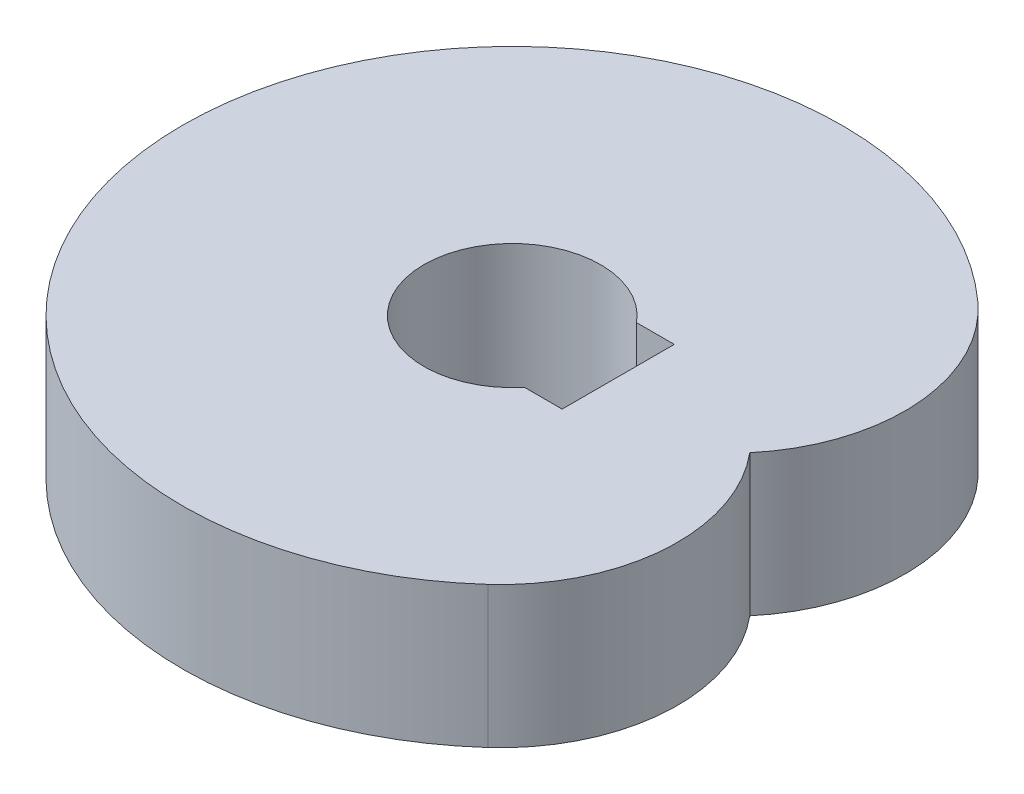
ISO-10303-21;
HEADER;
FILE_DESCRIPTION(('STEP AP214'),'2;1');
FILE_NAME('part.step','',(''),(''),'','','');
FILE_SCHEMA(('AUTOMOTIVE_DESIGN { 1 0 10303 214 1 1 1 1 }'));
ENDSEC;
DATA;
#1=APPLICATION_CONTEXT('core data for automotive mechanical design processes');
#2=APPLICATION_PROTOCOL_DEFINITION('international standard','automotive_design',2000,#1);
#3=PRODUCT_CONTEXT('',#1,'mechanical');
#4=PRODUCT('Part','Part','',(#3));
#5=PRODUCT_RELATED_PRODUCT_CATEGORY('part','',(#4));
#6=PRODUCT_DEFINITION_FORMATION('','',#4);
#7=PRODUCT_DEFINITION_CONTEXT('part definition',#1,'design');
#8=PRODUCT_DEFINITION('design','',#6,#7);
#9=PRODUCT_DEFINITION_SHAPE('','',#8);
#10=(LENGTH_UNIT() NAMED_UNIT(*) SI_UNIT(.MILLI.,.METRE.));
#11=(NAMED_UNIT(*) PLANE_ANGLE_UNIT() SI_UNIT($,.RADIAN.));
#12=(NAMED_UNIT(*) SI_UNIT($,.STERADIAN.) SOLID_ANGLE_UNIT());
#13=UNCERTAINTY_MEASURE_WITH_UNIT(LENGTH_MEASURE(1.E-05),#10,'distance_accuracy_value','');
#14=(GEOMETRIC_REPRESENTATION_CONTEXT(3) GLOBAL_UNCERTAINTY_ASSIGNED_CONTEXT((#13)) GLOBAL_UNIT_ASSIGNED_CONTEXT((#10,
#11,#12)) REPRESENTATION_CONTEXT('',''));
#15=CARTESIAN_POINT('',(0.,0.,0.));
#16=DIRECTION('',(0.,0.,1.));
#17=DIRECTION('',(1.,0.,0.));
#18=AXIS2_PLACEMENT_3D('',#15,#16,#17);
#19=CARTESIAN_POINT('',(-12.9999999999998,0.,119.));
#20=DIRECTION('',(0.,0.,1.));
#21=DIRECTION('',(1.,0.,0.));
#22=AXIS2_PLACEMENT_3D('',#19,#20,#21);
#23=PLANE('',#22);
#24=DIRECTION('',(0.,1.,0.));
#25=VECTOR('',#24,1.);
#26=CARTESIAN_POINT('',(144.897377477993,300.,119.));
#27=LINE('',#26,#25);
#28=CARTESIAN_POINT('',(144.897377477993,0.,119.));
#29=VERTEX_POINT('',#28);
#30=CARTESIAN_POINT('',(144.897377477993,300.,119.));
#31=VERTEX_POINT('',#30);
#32=EDGE_CURVE('E124',#29,#31,#27,.T.);
#33=ORIENTED_EDGE('',*,*,#32,.T.);
#34=DIRECTION('',(1.,0.,0.));
#35=VECTOR('',#34,1.);
#36=CARTESIAN_POINT('',(-12.9999999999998,300.,119.));
#37=LINE('',#36,#35);
#38=CARTESIAN_POINT('',(225.,300.,119.));
#39=VERTEX_POINT('',#38);
#40=EDGE_CURVE('E114',#31,#39,#37,.T.);
#41=ORIENTED_EDGE('',*,*,#40,.T.);
#42=DIRECTION('',(0.,1.,0.));
#43=VECTOR('',#42,1.);
#44=CARTESIAN_POINT('',(225.,0.,119.));
#45=LINE('',#44,#43);
#46=CARTESIAN_POINT('',(225.,0.,119.));
#47=VERTEX_POINT('',#46);
#48=EDGE_CURVE('E11',#47,#39,#45,.T.);
#49=ORIENTED_EDGE('',*,*,#48,.F.);
#50=DIRECTION('',(1.,0.,0.));
#51=VECTOR('',#50,1.);
#52=CARTESIAN_POINT('',(0.,0.,119.));
#53=LINE('',#52,#51);
#54=EDGE_CURVE('E121',#29,#47,#53,.T.);
#55=ORIENTED_EDGE('',*,*,#54,.F.);
#56=EDGE_LOOP('',(#33,#41,#49,#55));
#57=FACE_BOUND('',#56,.T.);
#58=ADVANCED_FACE('F16',(#57),#23,.F.);
#59=CARTESIAN_POINT('',(225.,0.,-119.));
#60=DIRECTION('',(1.,0.,0.));
#61=DIRECTION('',(0.,1.,0.));
#62=AXIS2_PLACEMENT_3D('',#59,#60,#61);
#63=PLANE('',#62);
#64=DIRECTION('',(0.,0.,-1.));
#65=VECTOR('',#64,1.);
#66=CARTESIAN_POINT('',(225.,300.,-119.));
#67=LINE('',#66,#65);
#68=CARTESIAN_POINT('',(225.,300.,-119.));
#69=VERTEX_POINT('',#68);
#70=EDGE_CURVE('E158',#39,#69,#67,.T.);
#71=ORIENTED_EDGE('',*,*,#70,.T.);
#72=DIRECTION('',(0.,1.,0.));
#73=VECTOR('',#72,1.);
#74=CARTESIAN_POINT('',(225.,0.,-119.));
#75=LINE('',#74,#73);
#76=CARTESIAN_POINT('',(225.,0.,-119.));
#77=VERTEX_POINT('',#76);
#78=EDGE_CURVE('E26',#77,#69,#75,.T.);
#79=ORIENTED_EDGE('',*,*,#78,.F.);
#80=DIRECTION('',(0.,0.,-1.));
#81=VECTOR('',#80,1.);
#82=CARTESIAN_POINT('',(225.,0.,-119.));
#83=LINE('',#82,#81);
#84=EDGE_CURVE('E157',#47,#77,#83,.T.);
#85=ORIENTED_EDGE('',*,*,#84,.F.);
#86=ORIENTED_EDGE('',*,*,#48,.T.);
#87=EDGE_LOOP('',(#71,#79,#85,#86));
#88=FACE_BOUND('',#87,.T.);
#89=ADVANCED_FACE('F205',(#88),#63,.F.);
#90=CARTESIAN_POINT('',(-12.9999999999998,0.,-119.));
#91=DIRECTION('',(0.,0.,-1.));
#92=DIRECTION('',(0.,-1.,0.));
#93=AXIS2_PLACEMENT_3D('',#90,#91,#92);
#94=PLANE('',#93);
#95=DIRECTION('',(0.,-1.,0.));
#96=VECTOR('',#95,1.);
#97=CARTESIAN_POINT('',(144.897377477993,300.,-119.));
#98=LINE('',#97,#96);
#99=CARTESIAN_POINT('',(144.897377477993,300.,-119.));
#100=VERTEX_POINT('',#99);
#101=CARTESIAN_POINT('',(144.897377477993,0.,-119.));
#102=VERTEX_POINT('',#101);
#103=EDGE_CURVE('E148',#100,#102,#98,.T.);
#104=ORIENTED_EDGE('',*,*,#103,.T.);
#105=DIRECTION('',(-1.,0.,0.));
#106=VECTOR('',#105,1.);
#107=CARTESIAN_POINT('',(-12.9999999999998,0.,-119.));
#108=LINE('',#107,#106);
#109=EDGE_CURVE('E129',#77,#102,#108,.T.);
#110=ORIENTED_EDGE('',*,*,#109,.F.);
#111=ORIENTED_EDGE('',*,*,#78,.T.);
#112=DIRECTION('',(-1.,0.,0.));
#113=VECTOR('',#112,1.);
#114=CARTESIAN_POINT('',(-12.9999999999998,300.,-119.));
#115=LINE('',#114,#113);
#116=EDGE_CURVE('E57',#69,#100,#115,.T.);
#117=ORIENTED_EDGE('',*,*,#116,.T.);
#118=EDGE_LOOP('',(#104,#110,#111,#117));
#119=FACE_BOUND('',#118,.T.);
#120=ADVANCED_FACE('F18',(#119),#94,.F.);
#121=CARTESIAN_POINT('',(0.,0.,0.));
#122=DIRECTION('',(0.,1.,0.));
#123=DIRECTION('',(1.,0.,0.));
#124=AXIS2_PLACEMENT_3D('',#121,#122,#123);
#125=PLANE('',#124);
#126=ORIENTED_EDGE('',*,*,#84,.T.);
#127=ORIENTED_EDGE('',*,*,#109,.T.);
#128=CARTESIAN_POINT('',(0.,0.,0.));
#129=DIRECTION('',(0.,1.,0.));
#130=DIRECTION('',(0.,0.,1.));
#131=AXIS2_PLACEMENT_3D('',#128,#129,#130);
#132=CIRCLE('',#131,187.5);
#133=EDGE_CURVE('E132',#102,#29,#132,.T.);
#134=ORIENTED_EDGE('',*,*,#133,.T.);
#135=ORIENTED_EDGE('',*,*,#54,.T.);
#136=EDGE_LOOP('',(#126,#127,#134,#135));
#137=FACE_BOUND('',#136,.T.);
#138=CARTESIAN_POINT('',(217.46744706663,0.,241.522068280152));
#139=DIRECTION('',(0.,1.,0.));
#140=DIRECTION('',(0.,0.,1.));
#141=AXIS2_PLACEMENT_3D('',#138,#139,#140);
#142=CIRCLE('',#141,375.);
#143=CARTESIAN_POINT('',(468.391424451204,0.,520.201377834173));
#144=VERTEX_POINT('',#143);
#145=CARTESIAN_POINT('',(504.333427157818,0.,-1.38777878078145E-13));
#146=VERTEX_POINT('',#145);
#147=EDGE_CURVE('E165',#144,#146,#142,.T.);
#148=ORIENTED_EDGE('',*,*,#147,.F.);
#149=CARTESIAN_POINT('',(0.,0.,0.));
#150=DIRECTION('',(0.,1.,0.));
#151=DIRECTION('',(0.,0.,1.));
#152=AXIS2_PLACEMENT_3D('',#149,#150,#151);
#153=CIRCLE('',#152,700.);
#154=CARTESIAN_POINT('',(468.391424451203,0.,-520.201377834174));
#155=VERTEX_POINT('',#154);
#156=EDGE_CURVE('E152',#155,#144,#153,.T.);
#157=ORIENTED_EDGE('',*,*,#156,.F.);
#158=CARTESIAN_POINT('',(217.46744706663,0.,-241.522068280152));
#159=DIRECTION('',(0.,1.,0.));
#160=DIRECTION('',(0.,0.,1.));
#161=AXIS2_PLACEMENT_3D('',#158,#159,#160);
#162=CIRCLE('',#161,375.);
#163=EDGE_CURVE('E164',#146,#155,#162,.T.);
#164=ORIENTED_EDGE('',*,*,#163,.F.);
#165=EDGE_LOOP('',(#148,#157,#164));
#166=FACE_BOUND('',#165,.T.);
#167=ADVANCED_FACE('F133',(#137,#166),#125,.F.);
#168=CARTESIAN_POINT('',(0.,300.,0.));
#169=DIRECTION('',(0.,1.,0.));
#170=DIRECTION('',(1.,0.,0.));
#171=AXIS2_PLACEMENT_3D('',#168,#169,#170);
#172=PLANE('',#171);
#173=ORIENTED_EDGE('',*,*,#116,.F.);
#174=ORIENTED_EDGE('',*,*,#70,.F.);
#175=ORIENTED_EDGE('',*,*,#40,.F.);
#176=CARTESIAN_POINT('',(0.,300.,0.));
#177=DIRECTION('',(0.,1.,0.));
#178=DIRECTION('',(0.,0.,1.));
#179=AXIS2_PLACEMENT_3D('',#176,#177,#178);
#180=CIRCLE('',#179,187.5);
#181=EDGE_CURVE('E140',#100,#31,#180,.T.);
#182=ORIENTED_EDGE('',*,*,#181,.F.);
#183=EDGE_LOOP('',(#173,#174,#175,#182));
#184=FACE_BOUND('',#183,.T.);
#185=CARTESIAN_POINT('',(217.46744706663,300.,241.522068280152));
#186=DIRECTION('',(0.,1.,0.));
#187=DIRECTION('',(0.,0.,1.));
#188=AXIS2_PLACEMENT_3D('',#185,#186,#187);
#189=CIRCLE('',#188,375.);
#190=CARTESIAN_POINT('',(468.391424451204,300.,520.201377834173));
#191=VERTEX_POINT('',#190);
#192=CARTESIAN_POINT('',(504.333427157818,300.,-1.38777878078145E-13));
#193=VERTEX_POINT('',#192);
#194=EDGE_CURVE('E170',#191,#193,#189,.T.);
#195=ORIENTED_EDGE('',*,*,#194,.T.);
#196=CARTESIAN_POINT('',(217.46744706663,300.,-241.522068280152));
#197=DIRECTION('',(0.,1.,0.));
#198=DIRECTION('',(0.,0.,1.));
#199=AXIS2_PLACEMENT_3D('',#196,#197,#198);
#200=CIRCLE('',#199,375.);
#201=CARTESIAN_POINT('',(468.391424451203,300.,-520.201377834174));
#202=VERTEX_POINT('',#201);
#203=EDGE_CURVE('E104',#193,#202,#200,.T.);
#204=ORIENTED_EDGE('',*,*,#203,.T.);
#205=CARTESIAN_POINT('',(0.,300.,0.));
#206=DIRECTION('',(0.,1.,0.));
#207=DIRECTION('',(0.,0.,1.));
#208=AXIS2_PLACEMENT_3D('',#205,#206,#207);
#209=CIRCLE('',#208,700.);
#210=EDGE_CURVE('E73',#202,#191,#209,.T.);
#211=ORIENTED_EDGE('',*,*,#210,.T.);
#212=EDGE_LOOP('',(#195,#204,#211));
#213=FACE_BOUND('',#212,.T.);
#214=ADVANCED_FACE('F206',(#184,#213),#172,.T.);
#215=CARTESIAN_POINT('',(0.,300.,0.));
#216=DIRECTION('',(0.,-1.,0.));
#217=DIRECTION('',(0.,0.,-1.));
#218=AXIS2_PLACEMENT_3D('',#215,#216,#217);
#219=CYLINDRICAL_SURFACE('',#218,187.5);
#220=ORIENTED_EDGE('',*,*,#103,.F.);
#221=ORIENTED_EDGE('',*,*,#181,.T.);
#222=ORIENTED_EDGE('',*,*,#32,.F.);
#223=ORIENTED_EDGE('',*,*,#133,.F.);
#224=EDGE_LOOP('',(#220,#221,#222,#223));
#225=FACE_BOUND('',#224,.T.);
#226=ADVANCED_FACE('F139',(#225),#219,.F.);
#227=CARTESIAN_POINT('',(0.,300.,0.));
#228=DIRECTION('',(0.,-1.,0.));
#229=DIRECTION('',(0.,0.,-1.));
#230=AXIS2_PLACEMENT_3D('',#227,#228,#229);
#231=CYLINDRICAL_SURFACE('',#230,700.);
#232=ORIENTED_EDGE('',*,*,#156,.T.);
#233=DIRECTION('',(0.,-1.,0.));
#234=VECTOR('',#233,1.);
#235=CARTESIAN_POINT('',(468.391424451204,300.,520.201377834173));
#236=LINE('',#235,#234);
#237=EDGE_CURVE('E176',#191,#144,#236,.T.);
#238=ORIENTED_EDGE('',*,*,#237,.F.);
#239=ORIENTED_EDGE('',*,*,#210,.F.);
#240=DIRECTION('',(0.,-1.,0.));
#241=VECTOR('',#240,1.);
#242=CARTESIAN_POINT('',(468.391424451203,300.,-520.201377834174));
#243=LINE('',#242,#241);
#244=EDGE_CURVE('E161',#202,#155,#243,.T.);
#245=ORIENTED_EDGE('',*,*,#244,.T.);
#246=EDGE_LOOP('',(#232,#238,#239,#245));
#247=FACE_BOUND('',#246,.T.);
#248=ADVANCED_FACE('F214',(#247),#231,.T.);
#249=CARTESIAN_POINT('',(217.46744706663,300.,-241.522068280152));
#250=DIRECTION('',(0.,-1.,0.));
#251=DIRECTION('',(0.,0.,-1.));
#252=AXIS2_PLACEMENT_3D('',#249,#250,#251);
#253=CYLINDRICAL_SURFACE('',#252,375.);
#254=ORIENTED_EDGE('',*,*,#163,.T.);
#255=ORIENTED_EDGE('',*,*,#244,.F.);
#256=ORIENTED_EDGE('',*,*,#203,.F.);
#257=DIRECTION('',(0.,-1.,0.));
#258=VECTOR('',#257,1.);
#259=CARTESIAN_POINT('',(504.333427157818,300.,-1.38777878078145E-13));
#260=LINE('',#259,#258);
#261=EDGE_CURVE('E168',#193,#146,#260,.T.);
#262=ORIENTED_EDGE('',*,*,#261,.T.);
#263=EDGE_LOOP('',(#254,#255,#256,#262));
#264=FACE_BOUND('',#263,.T.);
#265=ADVANCED_FACE('F226',(#264),#253,.T.);
#266=CARTESIAN_POINT('',(217.46744706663,300.,241.522068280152));
#267=DIRECTION('',(0.,-1.,0.));
#268=DIRECTION('',(0.,0.,-1.));
#269=AXIS2_PLACEMENT_3D('',#266,#267,#268);
#270=CYLINDRICAL_SURFACE('',#269,375.);
#271=ORIENTED_EDGE('',*,*,#147,.T.);
#272=ORIENTED_EDGE('',*,*,#261,.F.);
#273=ORIENTED_EDGE('',*,*,#194,.F.);
#274=ORIENTED_EDGE('',*,*,#237,.T.);
#275=EDGE_LOOP('',(#271,#272,#273,#274));
#276=FACE_BOUND('',#275,.T.);
#277=ADVANCED_FACE('F230',(#276),#270,.T.);
#278=CLOSED_SHELL('',(#58,#89,#120,#167,#214,#226,#248,#265,#277));
#279=MANIFOLD_SOLID_BREP('B1',#278);
#280=ADVANCED_BREP_SHAPE_REPRESENTATION('',(#18,#279),#14);
#281=SHAPE_DEFINITION_REPRESENTATION(#9,#280);
ENDSEC;
END-ISO-10303-21;
